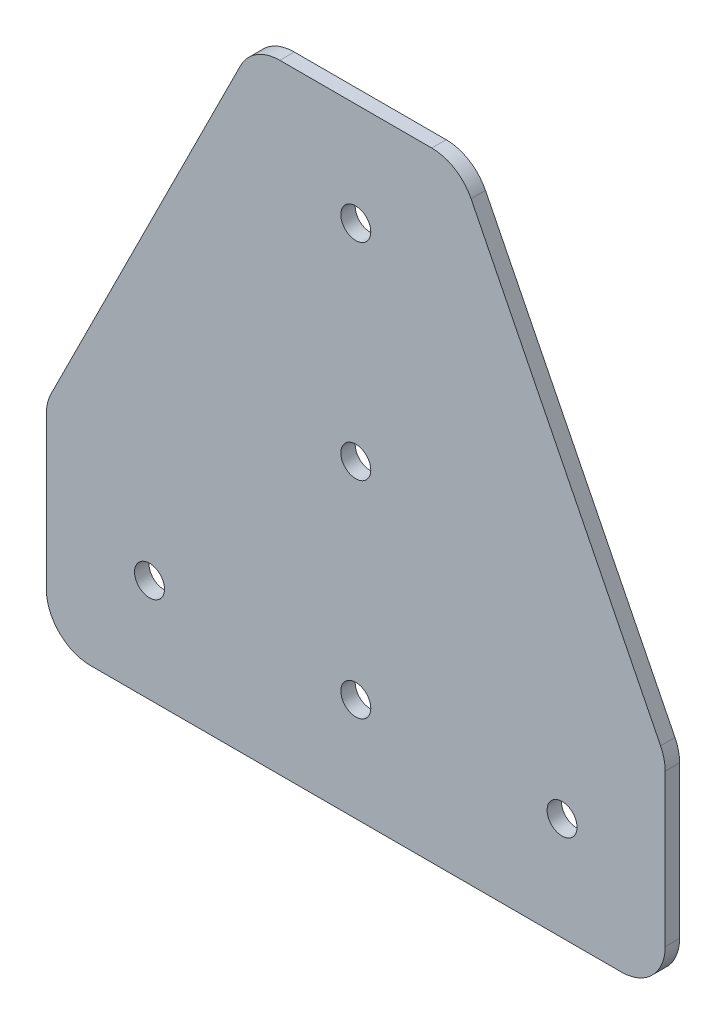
ISO-10303-21;
HEADER;
FILE_DESCRIPTION(('STEP AP214'),'2;1');
FILE_NAME('part.step','',(''),(''),'','','');
FILE_SCHEMA(('AUTOMOTIVE_DESIGN { 1 0 10303 214 1 1 1 1 }'));
ENDSEC;
DATA;
#1=APPLICATION_CONTEXT('core data for automotive mechanical design processes');
#2=APPLICATION_PROTOCOL_DEFINITION('international standard','automotive_design',2000,#1);
#3=PRODUCT_CONTEXT('',#1,'mechanical');
#4=PRODUCT('Part','Part','',(#3));
#5=PRODUCT_RELATED_PRODUCT_CATEGORY('part','',(#4));
#6=PRODUCT_DEFINITION_FORMATION('','',#4);
#7=PRODUCT_DEFINITION_CONTEXT('part definition',#1,'design');
#8=PRODUCT_DEFINITION('design','',#6,#7);
#9=PRODUCT_DEFINITION_SHAPE('','',#8);
#10=(LENGTH_UNIT() NAMED_UNIT(*) SI_UNIT(.MILLI.,.METRE.));
#11=(NAMED_UNIT(*) PLANE_ANGLE_UNIT() SI_UNIT($,.RADIAN.));
#12=(NAMED_UNIT(*) SI_UNIT($,.STERADIAN.) SOLID_ANGLE_UNIT());
#13=UNCERTAINTY_MEASURE_WITH_UNIT(LENGTH_MEASURE(1.E-05),#10,'distance_accuracy_value','');
#14=(GEOMETRIC_REPRESENTATION_CONTEXT(3) GLOBAL_UNCERTAINTY_ASSIGNED_CONTEXT((#13)) GLOBAL_UNIT_ASSIGNED_CONTEXT((#10,
#11,#12)) REPRESENTATION_CONTEXT('',''));
#15=CARTESIAN_POINT('',(0.,0.,0.));
#16=DIRECTION('',(0.,0.,1.));
#17=DIRECTION('',(1.,0.,0.));
#18=AXIS2_PLACEMENT_3D('',#15,#16,#17);
#19=CARTESIAN_POINT('',(-11.3665,68.199,0.));
#20=DIRECTION('',(0.,0.,1.));
#21=DIRECTION('',(1.,0.,0.));
#22=AXIS2_PLACEMENT_3D('',#19,#20,#21);
#23=PLANE('',#22);
#24=CARTESIAN_POINT('',(29.257625,4.841875,0.));
#25=DIRECTION('',(0.,0.,-1.));
#26=DIRECTION('',(-1.,0.,0.));
#27=AXIS2_PLACEMENT_3D('',#24,#25,#26);
#28=CIRCLE('',#27,4.841875);
#29=CARTESIAN_POINT('',(29.257625,0.,0.));
#30=VERTEX_POINT('',#29);
#31=CARTESIAN_POINT('',(34.0995,4.841875,0.));
#32=VERTEX_POINT('',#31);
#33=EDGE_CURVE('E110',#30,#32,#28,.F.);
#34=ORIENTED_EDGE('',*,*,#33,.F.);
#35=DIRECTION('',(1.,0.,0.));
#36=VECTOR('',#35,1.);
#37=CARTESIAN_POINT('',(-34.0995,0.,0.));
#38=LINE('',#37,#36);
#39=CARTESIAN_POINT('',(-29.257625,0.,0.));
#40=VERTEX_POINT('',#39);
#41=EDGE_CURVE('E102',#30,#40,#38,.F.);
#42=ORIENTED_EDGE('',*,*,#41,.T.);
#43=CARTESIAN_POINT('',(-29.257625,4.841875,0.));
#44=DIRECTION('',(0.,0.,-1.));
#45=DIRECTION('',(-1.,0.,0.));
#46=AXIS2_PLACEMENT_3D('',#43,#44,#45);
#47=CIRCLE('',#46,4.841875);
#48=CARTESIAN_POINT('',(-34.0995,4.841875,0.));
#49=VERTEX_POINT('',#48);
#50=EDGE_CURVE('E186',#49,#40,#47,.F.);
#51=ORIENTED_EDGE('',*,*,#50,.F.);
#52=DIRECTION('',(0.,1.,0.));
#53=VECTOR('',#52,1.);
#54=CARTESIAN_POINT('',(-34.0995,0.,0.));
#55=LINE('',#54,#53);
#56=CARTESIAN_POINT('',(-34.0995,21.5899883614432,0.));
#57=VERTEX_POINT('',#56);
#58=EDGE_CURVE('E137',#49,#57,#55,.T.);
#59=ORIENTED_EDGE('',*,*,#58,.T.);
#60=CARTESIAN_POINT('',(-29.257625,21.5899883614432,0.));
#61=DIRECTION('',(0.,0.,-1.));
#62=DIRECTION('',(-1.,0.,0.));
#63=AXIS2_PLACEMENT_3D('',#60,#61,#62);
#64=CIRCLE('',#63,4.841875);
#65=CARTESIAN_POINT('',(-33.5883296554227,23.7553406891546,0.));
#66=VERTEX_POINT('',#65);
#67=EDGE_CURVE('E189',#66,#57,#64,.F.);
#68=ORIENTED_EDGE('',*,*,#67,.F.);
#69=DIRECTION('',(0.447213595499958,0.894427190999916,0.));
#70=VECTOR('',#69,1.);
#71=CARTESIAN_POINT('',(-34.0995,22.733,0.));
#72=LINE('',#71,#70);
#73=CARTESIAN_POINT('',(-12.7047613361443,65.5224773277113,0.));
#74=VERTEX_POINT('',#73);
#75=EDGE_CURVE('E141',#66,#74,#72,.T.);
#76=ORIENTED_EDGE('',*,*,#75,.T.);
#77=CARTESIAN_POINT('',(-8.3740566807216,63.357125,0.));
#78=DIRECTION('',(0.,0.,-1.));
#79=DIRECTION('',(-1.,0.,0.));
#80=AXIS2_PLACEMENT_3D('',#77,#78,#79);
#81=CIRCLE('',#80,4.841875);
#82=CARTESIAN_POINT('',(-8.3740566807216,68.199,0.));
#83=VERTEX_POINT('',#82);
#84=EDGE_CURVE('E144',#83,#74,#81,.F.);
#85=ORIENTED_EDGE('',*,*,#84,.F.);
#86=DIRECTION('',(1.,0.,0.));
#87=VECTOR('',#86,1.);
#88=CARTESIAN_POINT('',(11.3665,68.199,0.));
#89=LINE('',#88,#87);
#90=CARTESIAN_POINT('',(8.3740566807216,68.199,0.));
#91=VERTEX_POINT('',#90);
#92=EDGE_CURVE('E145',#83,#91,#89,.T.);
#93=ORIENTED_EDGE('',*,*,#92,.T.);
#94=CARTESIAN_POINT('',(8.3740566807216,63.357125,0.));
#95=DIRECTION('',(0.,0.,-1.));
#96=DIRECTION('',(-1.,0.,0.));
#97=AXIS2_PLACEMENT_3D('',#94,#95,#96);
#98=CIRCLE('',#97,4.841875);
#99=CARTESIAN_POINT('',(12.7047613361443,65.5224773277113,0.));
#100=VERTEX_POINT('',#99);
#101=EDGE_CURVE('E148',#100,#91,#98,.F.);
#102=ORIENTED_EDGE('',*,*,#101,.F.);
#103=DIRECTION('',(0.447213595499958,-0.894427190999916,0.));
#104=VECTOR('',#103,1.);
#105=CARTESIAN_POINT('',(34.0995,22.733,0.));
#106=LINE('',#105,#104);
#107=CARTESIAN_POINT('',(33.5883296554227,23.7553406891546,0.));
#108=VERTEX_POINT('',#107);
#109=EDGE_CURVE('E149',#100,#108,#106,.T.);
#110=ORIENTED_EDGE('',*,*,#109,.T.);
#111=CARTESIAN_POINT('',(29.257625,21.5899883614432,0.));
#112=DIRECTION('',(0.,0.,-1.));
#113=DIRECTION('',(-1.,0.,0.));
#114=AXIS2_PLACEMENT_3D('',#111,#112,#113);
#115=CIRCLE('',#114,4.841875);
#116=CARTESIAN_POINT('',(34.0995,21.5899883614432,0.));
#117=VERTEX_POINT('',#116);
#118=EDGE_CURVE('E113',#117,#108,#115,.F.);
#119=ORIENTED_EDGE('',*,*,#118,.F.);
#120=DIRECTION('',(0.,1.,0.));
#121=VECTOR('',#120,1.);
#122=CARTESIAN_POINT('',(34.0995,0.,0.));
#123=LINE('',#122,#121);
#124=EDGE_CURVE('E107',#117,#32,#123,.F.);
#125=ORIENTED_EDGE('',*,*,#124,.T.);
#126=EDGE_LOOP('',(#34,#42,#51,#59,#68,#76,#85,#93,#102,#110,#119,#125));
#127=FACE_BOUND('',#126,.T.);
#128=CARTESIAN_POINT('',(0.,56.8325,0.));
#129=DIRECTION('',(0.,0.,1.));
#130=DIRECTION('',(1.,0.,0.));
#131=AXIS2_PLACEMENT_3D('',#128,#129,#130);
#132=CIRCLE('',#131,1.651);
#133=CARTESIAN_POINT('',(1.651,56.8325,0.));
#134=VERTEX_POINT('',#133);
#135=EDGE_CURVE('E136',#134,#134,#132,.T.);
#136=ORIENTED_EDGE('',*,*,#135,.T.);
#137=EDGE_LOOP('',(#136));
#138=FACE_BOUND('',#137,.T.);
#139=CARTESIAN_POINT('',(0.,11.3665,0.));
#140=DIRECTION('',(0.,0.,1.));
#141=DIRECTION('',(1.,0.,0.));
#142=AXIS2_PLACEMENT_3D('',#139,#140,#141);
#143=CIRCLE('',#142,1.651);
#144=CARTESIAN_POINT('',(1.651,11.3665,0.));
#145=VERTEX_POINT('',#144);
#146=EDGE_CURVE('E201',#145,#145,#143,.T.);
#147=ORIENTED_EDGE('',*,*,#146,.T.);
#148=EDGE_LOOP('',(#147));
#149=FACE_BOUND('',#148,.T.);
#150=CARTESIAN_POINT('',(22.733,11.3665,0.));
#151=DIRECTION('',(0.,0.,1.));
#152=DIRECTION('',(1.,0.,0.));
#153=AXIS2_PLACEMENT_3D('',#150,#151,#152);
#154=CIRCLE('',#153,1.651);
#155=CARTESIAN_POINT('',(24.384,11.3665,0.));
#156=VERTEX_POINT('',#155);
#157=EDGE_CURVE('E204',#156,#156,#154,.T.);
#158=ORIENTED_EDGE('',*,*,#157,.T.);
#159=EDGE_LOOP('',(#158));
#160=FACE_BOUND('',#159,.T.);
#161=CARTESIAN_POINT('',(-22.733,11.3665,0.));
#162=DIRECTION('',(0.,0.,1.));
#163=DIRECTION('',(1.,0.,0.));
#164=AXIS2_PLACEMENT_3D('',#161,#162,#163);
#165=CIRCLE('',#164,1.651);
#166=CARTESIAN_POINT('',(-21.082,11.3665,0.));
#167=VERTEX_POINT('',#166);
#168=EDGE_CURVE('E206',#167,#167,#165,.T.);
#169=ORIENTED_EDGE('',*,*,#168,.T.);
#170=EDGE_LOOP('',(#169));
#171=FACE_BOUND('',#170,.T.);
#172=CARTESIAN_POINT('',(0.,34.0995,0.));
#173=DIRECTION('',(0.,0.,1.));
#174=DIRECTION('',(1.,0.,0.));
#175=AXIS2_PLACEMENT_3D('',#172,#173,#174);
#176=CIRCLE('',#175,1.651);
#177=CARTESIAN_POINT('',(1.65100000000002,34.0995,0.));
#178=VERTEX_POINT('',#177);
#179=EDGE_CURVE('E20',#178,#178,#176,.T.);
#180=ORIENTED_EDGE('',*,*,#179,.T.);
#181=EDGE_LOOP('',(#180));
#182=FACE_BOUND('',#181,.T.);
#183=ADVANCED_FACE('F17',(#127,#138,#149,#160,#171,#182),#23,.F.);
#184=CARTESIAN_POINT('',(0.,34.0995,1.5875));
#185=DIRECTION('',(0.,0.,1.));
#186=DIRECTION('',(1.,0.,0.));
#187=AXIS2_PLACEMENT_3D('',#184,#185,#186);
#188=CYLINDRICAL_SURFACE('',#187,1.651);
#189=CARTESIAN_POINT('',(0.,34.0995,1.5875));
#190=DIRECTION('',(0.,0.,1.));
#191=DIRECTION('',(1.,0.,0.));
#192=AXIS2_PLACEMENT_3D('',#189,#190,#191);
#193=CIRCLE('',#192,1.651);
#194=CARTESIAN_POINT('',(1.65100000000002,34.0995,1.5875));
#195=VERTEX_POINT('',#194);
#196=EDGE_CURVE('E182',#195,#195,#193,.F.);
#197=ORIENTED_EDGE('',*,*,#196,.F.);
#198=EDGE_LOOP('',(#197));
#199=FACE_BOUND('',#198,.T.);
#200=ORIENTED_EDGE('',*,*,#179,.F.);
#201=EDGE_LOOP('',(#200));
#202=FACE_BOUND('',#201,.T.);
#203=ADVANCED_FACE('F214',(#199,#202),#188,.F.);
#204=CARTESIAN_POINT('',(-22.733,11.3665,1.5875));
#205=DIRECTION('',(0.,0.,1.));
#206=DIRECTION('',(1.,0.,0.));
#207=AXIS2_PLACEMENT_3D('',#204,#205,#206);
#208=CYLINDRICAL_SURFACE('',#207,1.651);
#209=CARTESIAN_POINT('',(-22.733,11.3665,1.5875));
#210=DIRECTION('',(0.,0.,1.));
#211=DIRECTION('',(1.,0.,0.));
#212=AXIS2_PLACEMENT_3D('',#209,#210,#211);
#213=CIRCLE('',#212,1.651);
#214=CARTESIAN_POINT('',(-21.082,11.3665,1.5875));
#215=VERTEX_POINT('',#214);
#216=EDGE_CURVE('E179',#215,#215,#213,.F.);
#217=ORIENTED_EDGE('',*,*,#216,.F.);
#218=EDGE_LOOP('',(#217));
#219=FACE_BOUND('',#218,.T.);
#220=ORIENTED_EDGE('',*,*,#168,.F.);
#221=EDGE_LOOP('',(#220));
#222=FACE_BOUND('',#221,.T.);
#223=ADVANCED_FACE('F216',(#219,#222),#208,.F.);
#224=CARTESIAN_POINT('',(22.733,11.3665,1.5875));
#225=DIRECTION('',(0.,0.,1.));
#226=DIRECTION('',(1.,0.,0.));
#227=AXIS2_PLACEMENT_3D('',#224,#225,#226);
#228=CYLINDRICAL_SURFACE('',#227,1.651);
#229=CARTESIAN_POINT('',(22.733,11.3665,1.5875));
#230=DIRECTION('',(0.,0.,1.));
#231=DIRECTION('',(1.,0.,0.));
#232=AXIS2_PLACEMENT_3D('',#229,#230,#231);
#233=CIRCLE('',#232,1.651);
#234=CARTESIAN_POINT('',(24.384,11.3665,1.5875));
#235=VERTEX_POINT('',#234);
#236=EDGE_CURVE('E176',#235,#235,#233,.F.);
#237=ORIENTED_EDGE('',*,*,#236,.F.);
#238=EDGE_LOOP('',(#237));
#239=FACE_BOUND('',#238,.T.);
#240=ORIENTED_EDGE('',*,*,#157,.F.);
#241=EDGE_LOOP('',(#240));
#242=FACE_BOUND('',#241,.T.);
#243=ADVANCED_FACE('F223',(#239,#242),#228,.F.);
#244=CARTESIAN_POINT('',(0.,11.3665,1.5875));
#245=DIRECTION('',(0.,0.,1.));
#246=DIRECTION('',(1.,0.,0.));
#247=AXIS2_PLACEMENT_3D('',#244,#245,#246);
#248=CYLINDRICAL_SURFACE('',#247,1.651);
#249=CARTESIAN_POINT('',(0.,11.3665,1.5875));
#250=DIRECTION('',(0.,0.,1.));
#251=DIRECTION('',(1.,0.,0.));
#252=AXIS2_PLACEMENT_3D('',#249,#250,#251);
#253=CIRCLE('',#252,1.651);
#254=CARTESIAN_POINT('',(1.651,11.3665,1.5875));
#255=VERTEX_POINT('',#254);
#256=EDGE_CURVE('E173',#255,#255,#253,.F.);
#257=ORIENTED_EDGE('',*,*,#256,.F.);
#258=EDGE_LOOP('',(#257));
#259=FACE_BOUND('',#258,.T.);
#260=ORIENTED_EDGE('',*,*,#146,.F.);
#261=EDGE_LOOP('',(#260));
#262=FACE_BOUND('',#261,.T.);
#263=ADVANCED_FACE('F281',(#259,#262),#248,.F.);
#264=CARTESIAN_POINT('',(0.,56.8325,1.5875));
#265=DIRECTION('',(0.,0.,1.));
#266=DIRECTION('',(1.,0.,0.));
#267=AXIS2_PLACEMENT_3D('',#264,#265,#266);
#268=CYLINDRICAL_SURFACE('',#267,1.651);
#269=CARTESIAN_POINT('',(0.,56.8325,1.5875));
#270=DIRECTION('',(0.,0.,1.));
#271=DIRECTION('',(1.,0.,0.));
#272=AXIS2_PLACEMENT_3D('',#269,#270,#271);
#273=CIRCLE('',#272,1.651);
#274=CARTESIAN_POINT('',(1.651,56.8325,1.5875));
#275=VERTEX_POINT('',#274);
#276=EDGE_CURVE('E170',#275,#275,#273,.F.);
#277=ORIENTED_EDGE('',*,*,#276,.F.);
#278=EDGE_LOOP('',(#277));
#279=FACE_BOUND('',#278,.T.);
#280=ORIENTED_EDGE('',*,*,#135,.F.);
#281=EDGE_LOOP('',(#280));
#282=FACE_BOUND('',#281,.T.);
#283=ADVANCED_FACE('F278',(#279,#282),#268,.F.);
#284=CARTESIAN_POINT('',(-34.0995,0.,1.5875));
#285=DIRECTION('',(0.,1.,0.));
#286=DIRECTION('',(0.,0.,1.));
#287=AXIS2_PLACEMENT_3D('',#284,#285,#286);
#288=PLANE('',#287);
#289=DIRECTION('',(0.,0.,-1.));
#290=VECTOR('',#289,1.);
#291=CARTESIAN_POINT('',(29.257625,0.,1.5875));
#292=LINE('',#291,#290);
#293=CARTESIAN_POINT('',(29.257625,0.,1.5875));
#294=VERTEX_POINT('',#293);
#295=EDGE_CURVE('E123',#294,#30,#292,.T.);
#296=ORIENTED_EDGE('',*,*,#295,.F.);
#297=DIRECTION('',(1.,0.,0.));
#298=VECTOR('',#297,1.);
#299=CARTESIAN_POINT('',(-11.3665,0.,1.5875));
#300=LINE('',#299,#298);
#301=CARTESIAN_POINT('',(-29.257625,0.,1.5875));
#302=VERTEX_POINT('',#301);
#303=EDGE_CURVE('E169',#302,#294,#300,.T.);
#304=ORIENTED_EDGE('',*,*,#303,.F.);
#305=DIRECTION('',(0.,0.,-1.));
#306=VECTOR('',#305,1.);
#307=CARTESIAN_POINT('',(-29.257625,0.,1.5875));
#308=LINE('',#307,#306);
#309=EDGE_CURVE('E185',#40,#302,#308,.F.);
#310=ORIENTED_EDGE('',*,*,#309,.F.);
#311=ORIENTED_EDGE('',*,*,#41,.F.);
#312=EDGE_LOOP('',(#296,#304,#310,#311));
#313=FACE_BOUND('',#312,.T.);
#314=ADVANCED_FACE('F275',(#313),#288,.F.);
#315=CARTESIAN_POINT('',(29.257625,4.841875,1.5875));
#316=DIRECTION('',(0.,0.,-1.));
#317=DIRECTION('',(-1.,0.,0.));
#318=AXIS2_PLACEMENT_3D('',#315,#316,#317);
#319=CYLINDRICAL_SURFACE('',#318,4.841875);
#320=ORIENTED_EDGE('',*,*,#33,.T.);
#321=DIRECTION('',(0.,0.,1.));
#322=VECTOR('',#321,1.);
#323=CARTESIAN_POINT('',(34.0995,4.841875,1.5875));
#324=LINE('',#323,#322);
#325=CARTESIAN_POINT('',(34.0995,4.841875,1.5875));
#326=VERTEX_POINT('',#325);
#327=EDGE_CURVE('E117',#32,#326,#324,.T.);
#328=ORIENTED_EDGE('',*,*,#327,.T.);
#329=CARTESIAN_POINT('',(29.257625,4.841875,1.5875));
#330=DIRECTION('',(0.,0.,-1.));
#331=DIRECTION('',(-1.,0.,0.));
#332=AXIS2_PLACEMENT_3D('',#329,#330,#331);
#333=CIRCLE('',#332,4.841875);
#334=EDGE_CURVE('E167',#294,#326,#333,.F.);
#335=ORIENTED_EDGE('',*,*,#334,.F.);
#336=ORIENTED_EDGE('',*,*,#295,.T.);
#337=EDGE_LOOP('',(#320,#328,#335,#336));
#338=FACE_BOUND('',#337,.T.);
#339=ADVANCED_FACE('F120',(#338),#319,.T.);
#340=CARTESIAN_POINT('',(34.0995,0.,1.5875));
#341=DIRECTION('',(-1.,0.,0.));
#342=DIRECTION('',(0.,0.,1.));
#343=AXIS2_PLACEMENT_3D('',#340,#341,#342);
#344=PLANE('',#343);
#345=ORIENTED_EDGE('',*,*,#327,.F.);
#346=ORIENTED_EDGE('',*,*,#124,.F.);
#347=DIRECTION('',(0.,0.,-1.));
#348=VECTOR('',#347,1.);
#349=CARTESIAN_POINT('',(34.0995,21.5899883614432,1.5875));
#350=LINE('',#349,#348);
#351=CARTESIAN_POINT('',(34.0995,21.5899883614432,1.5875));
#352=VERTEX_POINT('',#351);
#353=EDGE_CURVE('E129',#352,#117,#350,.T.);
#354=ORIENTED_EDGE('',*,*,#353,.F.);
#355=DIRECTION('',(0.,1.,0.));
#356=VECTOR('',#355,1.);
#357=CARTESIAN_POINT('',(34.0995,68.199,1.5875));
#358=LINE('',#357,#356);
#359=EDGE_CURVE('E127',#326,#352,#358,.T.);
#360=ORIENTED_EDGE('',*,*,#359,.F.);
#361=EDGE_LOOP('',(#345,#346,#354,#360));
#362=FACE_BOUND('',#361,.T.);
#363=ADVANCED_FACE('F125',(#362),#344,.F.);
#364=CARTESIAN_POINT('',(29.257625,21.5899883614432,1.5875));
#365=DIRECTION('',(0.,0.,-1.));
#366=DIRECTION('',(-1.,0.,0.));
#367=AXIS2_PLACEMENT_3D('',#364,#365,#366);
#368=CYLINDRICAL_SURFACE('',#367,4.841875);
#369=ORIENTED_EDGE('',*,*,#118,.T.);
#370=DIRECTION('',(0.,0.,1.));
#371=VECTOR('',#370,1.);
#372=CARTESIAN_POINT('',(33.5883296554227,23.7553406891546,1.5875));
#373=LINE('',#372,#371);
#374=CARTESIAN_POINT('',(33.5883296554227,23.7553406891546,1.5875));
#375=VERTEX_POINT('',#374);
#376=EDGE_CURVE('E150',#108,#375,#373,.T.);
#377=ORIENTED_EDGE('',*,*,#376,.T.);
#378=CARTESIAN_POINT('',(29.257625,21.5899883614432,1.5875));
#379=DIRECTION('',(0.,0.,-1.));
#380=DIRECTION('',(-1.,0.,0.));
#381=AXIS2_PLACEMENT_3D('',#378,#379,#380);
#382=CIRCLE('',#381,4.841875);
#383=EDGE_CURVE('E164',#352,#375,#382,.F.);
#384=ORIENTED_EDGE('',*,*,#383,.F.);
#385=ORIENTED_EDGE('',*,*,#353,.T.);
#386=EDGE_LOOP('',(#369,#377,#384,#385));
#387=FACE_BOUND('',#386,.T.);
#388=ADVANCED_FACE('F266',(#387),#368,.T.);
#389=CARTESIAN_POINT('',(34.0995,22.733,1.5875));
#390=DIRECTION('',(-0.894427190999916,-0.447213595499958,0.));
#391=DIRECTION('',(0.447213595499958,-0.894427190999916,0.));
#392=AXIS2_PLACEMENT_3D('',#389,#390,#391);
#393=PLANE('',#392);
#394=ORIENTED_EDGE('',*,*,#376,.F.);
#395=ORIENTED_EDGE('',*,*,#109,.F.);
#396=DIRECTION('',(0.,0.,-1.));
#397=VECTOR('',#396,1.);
#398=CARTESIAN_POINT('',(12.7047613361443,65.5224773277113,1.5875));
#399=LINE('',#398,#397);
#400=CARTESIAN_POINT('',(12.7047613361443,65.5224773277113,1.5875));
#401=VERTEX_POINT('',#400);
#402=EDGE_CURVE('E197',#401,#100,#399,.T.);
#403=ORIENTED_EDGE('',*,*,#402,.F.);
#404=DIRECTION('',(-0.447213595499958,0.894427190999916,0.));
#405=VECTOR('',#404,1.);
#406=CARTESIAN_POINT('',(33.5883296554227,23.7553406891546,1.5875));
#407=LINE('',#406,#405);
#408=EDGE_CURVE('E163',#375,#401,#407,.T.);
#409=ORIENTED_EDGE('',*,*,#408,.F.);
#410=EDGE_LOOP('',(#394,#395,#403,#409));
#411=FACE_BOUND('',#410,.T.);
#412=ADVANCED_FACE('F262',(#411),#393,.F.);
#413=CARTESIAN_POINT('',(8.3740566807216,63.357125,1.5875));
#414=DIRECTION('',(0.,0.,-1.));
#415=DIRECTION('',(-1.,0.,0.));
#416=AXIS2_PLACEMENT_3D('',#413,#414,#415);
#417=CYLINDRICAL_SURFACE('',#416,4.841875);
#418=ORIENTED_EDGE('',*,*,#101,.T.);
#419=DIRECTION('',(0.,0.,-1.));
#420=VECTOR('',#419,1.);
#421=CARTESIAN_POINT('',(8.3740566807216,68.199,1.5875));
#422=LINE('',#421,#420);
#423=CARTESIAN_POINT('',(8.3740566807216,68.199,1.5875));
#424=VERTEX_POINT('',#423);
#425=EDGE_CURVE('E147',#91,#424,#422,.F.);
#426=ORIENTED_EDGE('',*,*,#425,.T.);
#427=CARTESIAN_POINT('',(8.3740566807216,63.357125,1.5875));
#428=DIRECTION('',(0.,0.,-1.));
#429=DIRECTION('',(-1.,0.,0.));
#430=AXIS2_PLACEMENT_3D('',#427,#428,#429);
#431=CIRCLE('',#430,4.841875);
#432=EDGE_CURVE('E160',#401,#424,#431,.F.);
#433=ORIENTED_EDGE('',*,*,#432,.F.);
#434=ORIENTED_EDGE('',*,*,#402,.T.);
#435=EDGE_LOOP('',(#418,#426,#433,#434));
#436=FACE_BOUND('',#435,.T.);
#437=ADVANCED_FACE('F258',(#436),#417,.T.);
#438=CARTESIAN_POINT('',(11.3665,68.199,1.5875));
#439=DIRECTION('',(0.,-1.,0.));
#440=DIRECTION('',(0.,0.,-1.));
#441=AXIS2_PLACEMENT_3D('',#438,#439,#440);
#442=PLANE('',#441);
#443=ORIENTED_EDGE('',*,*,#425,.F.);
#444=ORIENTED_EDGE('',*,*,#92,.F.);
#445=DIRECTION('',(0.,0.,-1.));
#446=VECTOR('',#445,1.);
#447=CARTESIAN_POINT('',(-8.3740566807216,68.199,1.5875));
#448=LINE('',#447,#446);
#449=CARTESIAN_POINT('',(-8.3740566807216,68.199,1.5875));
#450=VERTEX_POINT('',#449);
#451=EDGE_CURVE('E194',#450,#83,#448,.T.);
#452=ORIENTED_EDGE('',*,*,#451,.F.);
#453=DIRECTION('',(1.,0.,0.));
#454=VECTOR('',#453,1.);
#455=CARTESIAN_POINT('',(-11.3665,68.199,1.5875));
#456=LINE('',#455,#454);
#457=EDGE_CURVE('E159',#424,#450,#456,.F.);
#458=ORIENTED_EDGE('',*,*,#457,.F.);
#459=EDGE_LOOP('',(#443,#444,#452,#458));
#460=FACE_BOUND('',#459,.T.);
#461=ADVANCED_FACE('F254',(#460),#442,.F.);
#462=CARTESIAN_POINT('',(-8.3740566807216,63.357125,1.5875));
#463=DIRECTION('',(0.,0.,-1.));
#464=DIRECTION('',(-1.,0.,0.));
#465=AXIS2_PLACEMENT_3D('',#462,#463,#464);
#466=CYLINDRICAL_SURFACE('',#465,4.841875);
#467=ORIENTED_EDGE('',*,*,#84,.T.);
#468=DIRECTION('',(0.,0.,1.));
#469=VECTOR('',#468,1.);
#470=CARTESIAN_POINT('',(-12.7047613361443,65.5224773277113,1.5875));
#471=LINE('',#470,#469);
#472=CARTESIAN_POINT('',(-12.7047613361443,65.5224773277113,1.5875));
#473=VERTEX_POINT('',#472);
#474=EDGE_CURVE('E143',#74,#473,#471,.T.);
#475=ORIENTED_EDGE('',*,*,#474,.T.);
#476=CARTESIAN_POINT('',(-8.3740566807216,63.357125,1.5875));
#477=DIRECTION('',(0.,0.,-1.));
#478=DIRECTION('',(-1.,0.,0.));
#479=AXIS2_PLACEMENT_3D('',#476,#477,#478);
#480=CIRCLE('',#479,4.841875);
#481=EDGE_CURVE('E156',#450,#473,#480,.F.);
#482=ORIENTED_EDGE('',*,*,#481,.F.);
#483=ORIENTED_EDGE('',*,*,#451,.T.);
#484=EDGE_LOOP('',(#467,#475,#482,#483));
#485=FACE_BOUND('',#484,.T.);
#486=ADVANCED_FACE('F250',(#485),#466,.T.);
#487=CARTESIAN_POINT('',(-34.0995,22.733,1.5875));
#488=DIRECTION('',(0.894427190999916,-0.447213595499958,0.));
#489=DIRECTION('',(0.447213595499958,0.894427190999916,0.));
#490=AXIS2_PLACEMENT_3D('',#487,#488,#489);
#491=PLANE('',#490);
#492=ORIENTED_EDGE('',*,*,#474,.F.);
#493=ORIENTED_EDGE('',*,*,#75,.F.);
#494=DIRECTION('',(0.,0.,-1.));
#495=VECTOR('',#494,1.);
#496=CARTESIAN_POINT('',(-33.5883296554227,23.7553406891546,1.5875));
#497=LINE('',#496,#495);
#498=CARTESIAN_POINT('',(-33.5883296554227,23.7553406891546,1.5875));
#499=VERTEX_POINT('',#498);
#500=EDGE_CURVE('E191',#499,#66,#497,.T.);
#501=ORIENTED_EDGE('',*,*,#500,.F.);
#502=DIRECTION('',(-0.447213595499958,-0.894427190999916,0.));
#503=VECTOR('',#502,1.);
#504=CARTESIAN_POINT('',(-12.7047613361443,65.5224773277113,1.5875));
#505=LINE('',#504,#503);
#506=EDGE_CURVE('E155',#473,#499,#505,.T.);
#507=ORIENTED_EDGE('',*,*,#506,.F.);
#508=EDGE_LOOP('',(#492,#493,#501,#507));
#509=FACE_BOUND('',#508,.T.);
#510=ADVANCED_FACE('F246',(#509),#491,.F.);
#511=CARTESIAN_POINT('',(-29.257625,21.5899883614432,1.5875));
#512=DIRECTION('',(0.,0.,-1.));
#513=DIRECTION('',(-1.,0.,0.));
#514=AXIS2_PLACEMENT_3D('',#511,#512,#513);
#515=CYLINDRICAL_SURFACE('',#514,4.841875);
#516=ORIENTED_EDGE('',*,*,#67,.T.);
#517=DIRECTION('',(0.,0.,-1.));
#518=VECTOR('',#517,1.);
#519=CARTESIAN_POINT('',(-34.0995,21.5899883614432,1.5875));
#520=LINE('',#519,#518);
#521=CARTESIAN_POINT('',(-34.0995,21.5899883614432,1.5875));
#522=VERTEX_POINT('',#521);
#523=EDGE_CURVE('E140',#57,#522,#520,.F.);
#524=ORIENTED_EDGE('',*,*,#523,.T.);
#525=CARTESIAN_POINT('',(-29.257625,21.5899883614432,1.5875));
#526=DIRECTION('',(0.,0.,-1.));
#527=DIRECTION('',(-1.,0.,0.));
#528=AXIS2_PLACEMENT_3D('',#525,#526,#527);
#529=CIRCLE('',#528,4.841875);
#530=EDGE_CURVE('E152',#499,#522,#529,.F.);
#531=ORIENTED_EDGE('',*,*,#530,.F.);
#532=ORIENTED_EDGE('',*,*,#500,.T.);
#533=EDGE_LOOP('',(#516,#524,#531,#532));
#534=FACE_BOUND('',#533,.T.);
#535=ADVANCED_FACE('F243',(#534),#515,.T.);
#536=CARTESIAN_POINT('',(-34.0995,0.,1.5875));
#537=DIRECTION('',(1.,0.,0.));
#538=DIRECTION('',(0.,0.,-1.));
#539=AXIS2_PLACEMENT_3D('',#536,#537,#538);
#540=PLANE('',#539);
#541=DIRECTION('',(0.,0.,-1.));
#542=VECTOR('',#541,1.);
#543=CARTESIAN_POINT('',(-34.0995,4.841875,1.5875));
#544=LINE('',#543,#542);
#545=CARTESIAN_POINT('',(-34.0995,4.841875,1.5875));
#546=VERTEX_POINT('',#545);
#547=EDGE_CURVE('E35',#546,#49,#544,.T.);
#548=ORIENTED_EDGE('',*,*,#547,.F.);
#549=DIRECTION('',(0.,1.,0.));
#550=VECTOR('',#549,1.);
#551=CARTESIAN_POINT('',(-34.0995,68.199,1.5875));
#552=LINE('',#551,#550);
#553=EDGE_CURVE('E26',#522,#546,#552,.F.);
#554=ORIENTED_EDGE('',*,*,#553,.F.);
#555=ORIENTED_EDGE('',*,*,#523,.F.);
#556=ORIENTED_EDGE('',*,*,#58,.F.);
#557=EDGE_LOOP('',(#548,#554,#555,#556));
#558=FACE_BOUND('',#557,.T.);
#559=ADVANCED_FACE('F235',(#558),#540,.F.);
#560=CARTESIAN_POINT('',(-29.257625,4.841875,1.5875));
#561=DIRECTION('',(0.,0.,-1.));
#562=DIRECTION('',(-1.,0.,0.));
#563=AXIS2_PLACEMENT_3D('',#560,#561,#562);
#564=CYLINDRICAL_SURFACE('',#563,4.841875);
#565=ORIENTED_EDGE('',*,*,#50,.T.);
#566=ORIENTED_EDGE('',*,*,#309,.T.);
#567=CARTESIAN_POINT('',(-29.257625,4.841875,1.5875));
#568=DIRECTION('',(0.,0.,-1.));
#569=DIRECTION('',(-1.,0.,0.));
#570=AXIS2_PLACEMENT_3D('',#567,#568,#569);
#571=CIRCLE('',#570,4.841875);
#572=EDGE_CURVE('E10',#546,#302,#571,.F.);
#573=ORIENTED_EDGE('',*,*,#572,.F.);
#574=ORIENTED_EDGE('',*,*,#547,.T.);
#575=EDGE_LOOP('',(#565,#566,#573,#574));
#576=FACE_BOUND('',#575,.T.);
#577=ADVANCED_FACE('F229',(#576),#564,.T.);
#578=CARTESIAN_POINT('',(-11.3665,68.199,1.5875));
#579=DIRECTION('',(0.,0.,1.));
#580=DIRECTION('',(1.,0.,0.));
#581=AXIS2_PLACEMENT_3D('',#578,#579,#580);
#582=PLANE('',#581);
#583=ORIENTED_EDGE('',*,*,#553,.T.);
#584=ORIENTED_EDGE('',*,*,#572,.T.);
#585=ORIENTED_EDGE('',*,*,#303,.T.);
#586=ORIENTED_EDGE('',*,*,#334,.T.);
#587=ORIENTED_EDGE('',*,*,#359,.T.);
#588=ORIENTED_EDGE('',*,*,#383,.T.);
#589=ORIENTED_EDGE('',*,*,#408,.T.);
#590=ORIENTED_EDGE('',*,*,#432,.T.);
#591=ORIENTED_EDGE('',*,*,#457,.T.);
#592=ORIENTED_EDGE('',*,*,#481,.T.);
#593=ORIENTED_EDGE('',*,*,#506,.T.);
#594=ORIENTED_EDGE('',*,*,#530,.T.);
#595=EDGE_LOOP('',(#583,#584,#585,#586,#587,#588,#589,#590,#591,#592,#593,#594));
#596=FACE_BOUND('',#595,.T.);
#597=ORIENTED_EDGE('',*,*,#276,.T.);
#598=EDGE_LOOP('',(#597));
#599=FACE_BOUND('',#598,.T.);
#600=ORIENTED_EDGE('',*,*,#256,.T.);
#601=EDGE_LOOP('',(#600));
#602=FACE_BOUND('',#601,.T.);
#603=ORIENTED_EDGE('',*,*,#236,.T.);
#604=EDGE_LOOP('',(#603));
#605=FACE_BOUND('',#604,.T.);
#606=ORIENTED_EDGE('',*,*,#216,.T.);
#607=EDGE_LOOP('',(#606));
#608=FACE_BOUND('',#607,.T.);
#609=ORIENTED_EDGE('',*,*,#196,.T.);
#610=EDGE_LOOP('',(#609));
#611=FACE_BOUND('',#610,.T.);
#612=ADVANCED_FACE('F227',(#596,#599,#602,#605,#608,#611),#582,.T.);
#613=CLOSED_SHELL('',(#183,#203,#223,#243,#263,#283,#314,#339,#363,#388,#412,#437,#461,#486,
#510,#535,#559,#577,#612));
#614=MANIFOLD_SOLID_BREP('B1',#613);
#615=ADVANCED_BREP_SHAPE_REPRESENTATION('',(#18,#614),#14);
#616=SHAPE_DEFINITION_REPRESENTATION(#9,#615);
ENDSEC;
END-ISO-10303-21;
